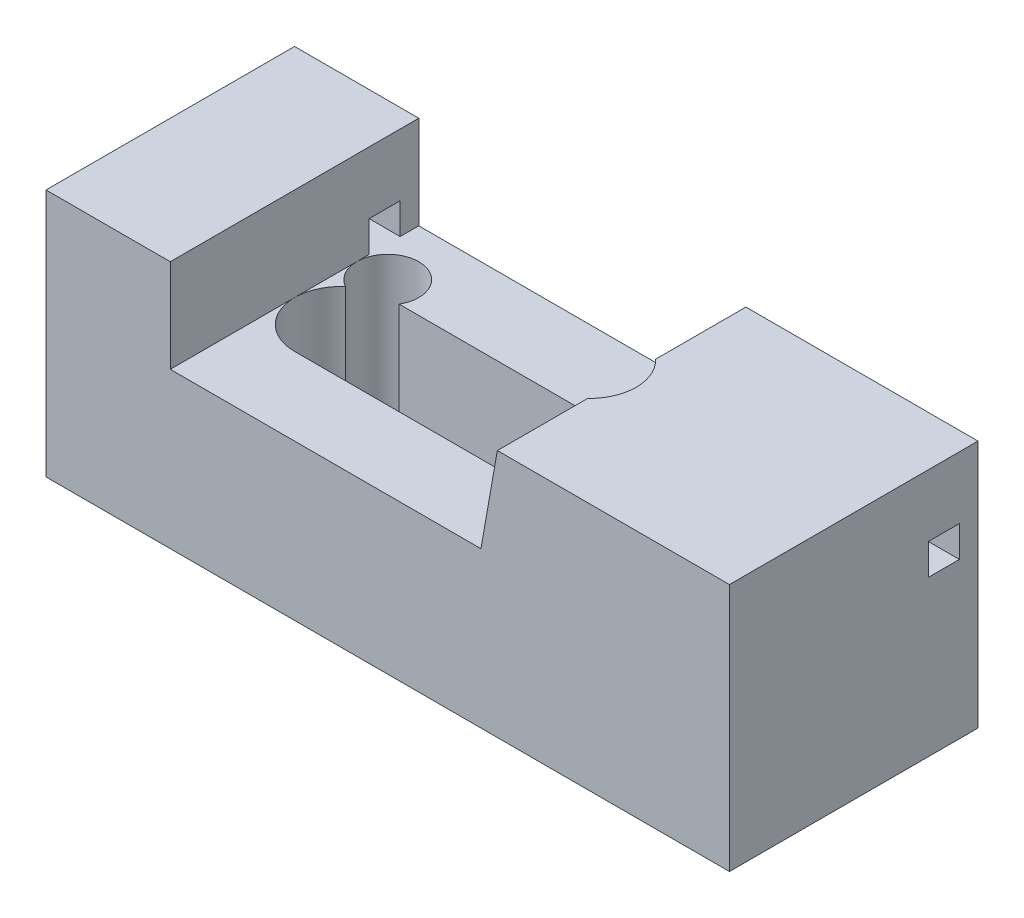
from build123d import *

# Parameters (mm, degrees)
LINEAR_AUSTRAGEN1_DEPTH         = 40
FORMSCHR_GE1_ANGLE              = 10
SCHNITT_LINEAR_AUSTRAGEN1_DEPTH = 124.693168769
SKIZZE3_R                       = 5
SCHNITT_LINEAR_AUSTRAGEN2_DEPTH = 124.693168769
SKIZZE4_W                       = 5
SKIZZE4_H                       = 5
SCHNITT_LINEAR_AUSTRAGEN3_DEPTH = 124.693168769


with BuildPart() as part:
    # Skizze1 → Linear austragen1 (new body)
    with BuildSketch(Plane.XY):
        Polygon((0, 0), (110, 0), (110, 40), (70, 40), (70, 25), (20, 25), (20, 40), (0, 40), align=None)
    extrude(amount=LINEAR_AUSTRAGEN1_DEPTH)

    # Formschr_ge1
    formschr_ge1_faces = [part.faces().sort_by_distance(p)[0] for p in [
        (70, 32.5, 20),
    ]]
    draft(formschr_ge1_faces, Plane(origin=(70, 25, 40), x_dir=(1, 0, 0), z_dir=(0, 1, 0)), FORMSCHR_GE1_ANGLE)

    # Skizze2 → Schnitt-Linear austragen1 (cut, through all)
    with BuildSketch(Plane(origin=(0, 0, 0), x_dir=(-1, 0, 0), z_dir=(0, 1, 0))):
        with BuildLine():
            Line((-27.5, 27.5), (-67.5, 27.5))
            ThreePointArc((-67.5, 27.5), (-75, 20), (-67.5, 12.5))
            Line((-67.5, 12.5), (-27.5, 12.5))
            ThreePointArc((-27.5, 12.5), (-20, 20), (-27.5, 27.5))
        make_face()
    extrude(amount=SCHNITT_LINEAR_AUSTRAGEN1_DEPTH, mode=Mode.SUBTRACT)

    # Skizze3 → Schnitt-Linear austragen2 (cut, through all)
    with BuildSketch(Plane(origin=(0, 40, 0), x_dir=(-1, 0, 0), z_dir=(0, 1, 0))):
        with Locations((-25, 10)):
            Circle(SKIZZE3_R)
    extrude(amount=-SCHNITT_LINEAR_AUSTRAGEN2_DEPTH, mode=Mode.SUBTRACT)

    # Skizze4 → Schnitt-Linear austragen3 (cut, through all)
    with BuildSketch(Plane.ZY):
        with Locations((5.5, 27.5)):
            Rectangle(SKIZZE4_W, SKIZZE4_H)
    extrude(amount=-SCHNITT_LINEAR_AUSTRAGEN3_DEPTH, mode=Mode.SUBTRACT)


solid = part.part
